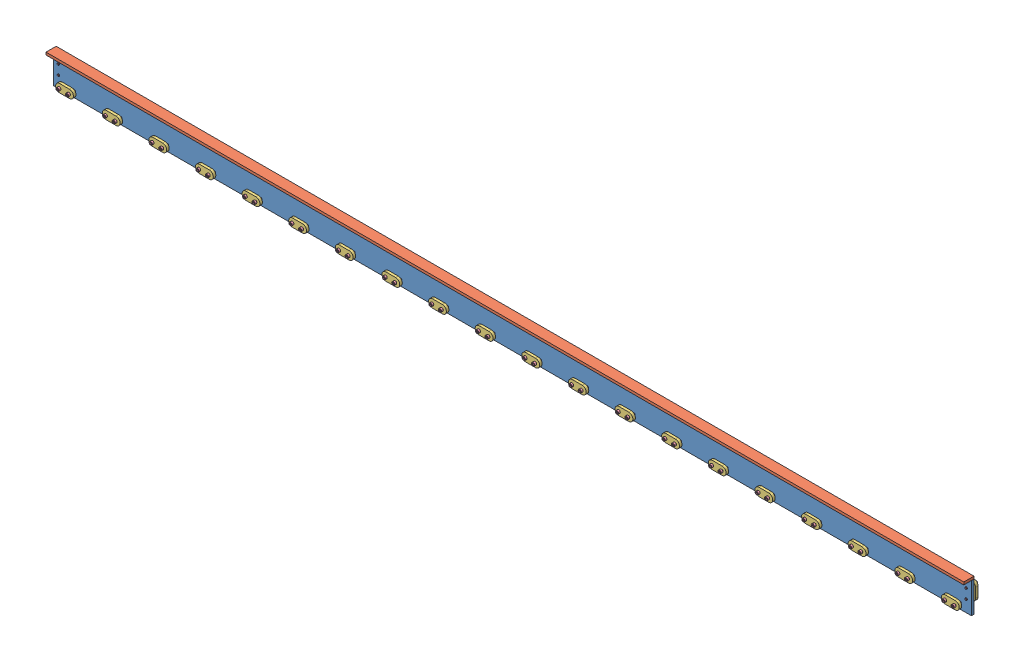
SolidWorks assembly fs-ua-angled-mount-assembly-with-screws.SLDASM, configuration Default (file format 9000). Lengths in mm.
Overall size (2292.35 82.55 44.16).
69 component instances, 4 part files, 6 mates.
Components (placement in the parent):
- fs-ua-angled-mount-assembly-1: fs-ua-angled-mount-assembly.SLDASM [Default] at origin size (2292.35 82.55 38)
  - fs-ua-angled-mount-vertical-component-1: fs-ua-angled-mount-vertical-component.SLDPRT [Default] at origin size (2292.35 76.2 6.35)
  - fs-ua-angled-mount-horizontal-component-1: fs-ua-angled-mount-horizontal-component.SLDPRT [Default] at (1146.175 76.2 12.7) size (2292.35 6.35 25.4)
  - fs-clamp-1: fs-clamp.SLDPRT [Default] at (27.94 15.24 12.8007) size (44.45 20.32 6.35)
  - fs-clamp-2: fs-clamp.SLDPRT [Default] at (144.3789 15.24 12.8007) size (44.45 20.32 6.35)
  - fs-clamp-3: fs-clamp.SLDPRT [Default] at (260.8179 15.24 12.8007) size (44.45 20.32 6.35)
  - fs-clamp-4: fs-clamp.SLDPRT [Default] at (377.2568 15.24 12.8007) size (44.45 20.32 6.35)
  - fs-clamp-5: fs-clamp.SLDPRT [Default] at (493.6957 15.24 12.8007) size (44.45 20.32 6.35)
  - fs-clamp-6: fs-clamp.SLDPRT [Default] at (610.1347 15.24 12.8007) size (44.45 20.32 6.35)
  - fs-clamp-7: fs-clamp.SLDPRT [Default] at (726.5736 15.24 12.8007) size (44.45 20.32 6.35)
  - fs-clamp-8: fs-clamp.SLDPRT [Default] at (843.0125 15.24 12.8007) size (44.45 20.32 6.35)
  - fs-clamp-9: fs-clamp.SLDPRT [Default] at (959.4515 15.24 12.8007) size (44.45 20.32 6.35)
  - fs-clamp-10: fs-clamp.SLDPRT [Default] at (1075.8904 15.24 12.8007) size (44.45 20.32 6.35)
  - fs-clamp-11: fs-clamp.SLDPRT [Default] at (1192.3293 15.24 12.8007) size (44.45 20.32 6.35)
  - fs-clamp-12: fs-clamp.SLDPRT [Default] at (1308.7683 15.24 12.8007) size (44.45 20.32 6.35)
  - fs-clamp-13: fs-clamp.SLDPRT [Default] at (1425.2072 15.24 12.8007) size (44.45 20.32 6.35)
  - fs-clamp-14: fs-clamp.SLDPRT [Default] at (1541.6461 15.24 12.8007) size (44.45 20.32 6.35)
  - fs-clamp-15: fs-clamp.SLDPRT [Default] at (1658.0851 15.24 12.8007) size (44.45 20.32 6.35)
  - fs-clamp-16: fs-clamp.SLDPRT [Default] at (1774.524 15.24 12.8007) size (44.45 20.32 6.35)
  - fs-clamp-17: fs-clamp.SLDPRT [Default] at (1890.9629 15.24 12.8007) size (44.45 20.32 6.35)
  - fs-clamp-18: fs-clamp.SLDPRT [Default] at (2007.4019 15.24 12.8007) size (44.45 20.32 6.35)
  - fs-clamp-19: fs-clamp.SLDPRT [Default] at (12.7 53.975 -12.5735) x (0 -1 0) z (0 0 1) size (44.45 20.32 6.35)
  - fs-clamp-20: fs-clamp.SLDPRT [Default] at (2279.65 29.845 -12.5985) x (0 1 0) z (0 0 1) size (44.45 20.32 6.35)
  - fs-clamp-21: fs-clamp.SLDPRT [Default] at (2123.8408 15.24 12.8007) size (44.45 20.32 6.35)
  - fs-clamp-22: fs-clamp.SLDPRT [Default] at (2240.2797 15.24 12.8007) size (44.45 20.32 6.35)
- socket head cap screw_ai-1: socket head cap screw_ai.sldprt [HX-SHCS 0.19-32x0.875x0.875-N] at (27.94 15.24 25.0524) x (0 0 -1) z (-0.570283 0.821448 0) size (27.05 7.94 7.94)
- socket head cap screw_ai-3: socket head cap screw_ai.sldprt [HX-SHCS 0.19-32x0.875x0.875-N] at (52.07 15.24 25.3347) x (0 0 -1) z (0.61191 -0.790927 0) size (27.05 7.94 7.94)
- socket head cap screw_ai-4: socket head cap screw_ai.sldprt [HX-SHCS 0.19-32x0.875x0.875-N] at (12.7 29.845 -18.7638) x (0 0 1) z (-0.601781 -0.798661 0) size (27.05 7.94 7.94)
- socket head cap screw_ai-5: socket head cap screw_ai.sldprt [HX-SHCS 0.19-32x0.875x0.875-N] at (12.7 53.975 -18.6513) x (0 0 1) z (0.101721 0.994813 0) size (27.05 7.94 7.94)
- socket head cap screw_ai-6: socket head cap screw_ai.sldprt [HX-SHCS 0.19-32x0.875x0.875-N] at (2279.65 29.845 -18.7537) x (0 0 1) z (-0.220834 -0.975311 0) size (27.05 7.94 7.94)
- socket head cap screw_ai-7: socket head cap screw_ai.sldprt [HX-SHCS 0.19-32x0.875x0.875-N] at (2279.65 53.975 -18.662) x (0 0 1) z (-0.85708 -0.515183 0) size (27.05 7.94 7.94)
- socket head cap screw_ai-8: socket head cap screw_ai.sldprt [HX-SHCS 0.19-32x0.875x0.875-N] at (144.3789 15.24 25.0524) x (0 0 -1) z (-0.570283 0.821448 0) size (27.05 7.94 7.94)
- socket head cap screw_ai-9: socket head cap screw_ai.sldprt [HX-SHCS 0.19-32x0.875x0.875-N] at (260.8179 15.24 25.0524) x (0 0 -1) z (-0.570283 0.821448 0) size (27.05 7.94 7.94)
- socket head cap screw_ai-10: socket head cap screw_ai.sldprt [HX-SHCS 0.19-32x0.875x0.875-N] at (377.2568 15.24 25.0524) x (0 0 -1) z (-0.570283 0.821448 0) size (27.05 7.94 7.94)
- socket head cap screw_ai-11: socket head cap screw_ai.sldprt [HX-SHCS 0.19-32x0.875x0.875-N] at (493.6957 15.24 25.0524) x (0 0 -1) z (-0.570283 0.821448 0) size (27.05 7.94 7.94)
- socket head cap screw_ai-12: socket head cap screw_ai.sldprt [HX-SHCS 0.19-32x0.875x0.875-N] at (610.1347 15.24 25.0524) x (0 0 -1) z (-0.570283 0.821448 0) size (27.05 7.94 7.94)
- socket head cap screw_ai-13: socket head cap screw_ai.sldprt [HX-SHCS 0.19-32x0.875x0.875-N] at (726.5736 15.24 25.0524) x (0 0 -1) z (-0.570283 0.821448 0) size (27.05 7.94 7.94)
- socket head cap screw_ai-14: socket head cap screw_ai.sldprt [HX-SHCS 0.19-32x0.875x0.875-N] at (843.0125 15.24 25.0524) x (0 0 -1) z (-0.570283 0.821448 0) size (27.05 7.94 7.94)
- socket head cap screw_ai-15: socket head cap screw_ai.sldprt [HX-SHCS 0.19-32x0.875x0.875-N] at (959.4515 15.24 25.0524) x (0 0 -1) z (-0.570283 0.821448 0) size (27.05 7.94 7.94)
- socket head cap screw_ai-16: socket head cap screw_ai.sldprt [HX-SHCS 0.19-32x0.875x0.875-N] at (1075.8904 15.24 25.0524) x (0 0 -1) z (-0.570283 0.821448 0) size (27.05 7.94 7.94)
- socket head cap screw_ai-17: socket head cap screw_ai.sldprt [HX-SHCS 0.19-32x0.875x0.875-N] at (1192.3293 15.24 25.0524) x (0 0 -1) z (-0.570283 0.821448 0) size (27.05 7.94 7.94)
- socket head cap screw_ai-18: socket head cap screw_ai.sldprt [HX-SHCS 0.19-32x0.875x0.875-N] at (1308.7683 15.24 25.0524) x (0 0 -1) z (-0.570283 0.821448 0) size (27.05 7.94 7.94)
- socket head cap screw_ai-19: socket head cap screw_ai.sldprt [HX-SHCS 0.19-32x0.875x0.875-N] at (1425.2072 15.24 25.0524) x (0 0 -1) z (-0.570283 0.821448 0) size (27.05 7.94 7.94)
- socket head cap screw_ai-20: socket head cap screw_ai.sldprt [HX-SHCS 0.19-32x0.875x0.875-N] at (1541.6461 15.24 25.0524) x (0 0 -1) z (-0.570283 0.821448 0) size (27.05 7.94 7.94)
- socket head cap screw_ai-21: socket head cap screw_ai.sldprt [HX-SHCS 0.19-32x0.875x0.875-N] at (1658.0851 15.24 25.0524) x (0 0 -1) z (-0.570283 0.821448 0) size (27.05 7.94 7.94)
- socket head cap screw_ai-22: socket head cap screw_ai.sldprt [HX-SHCS 0.19-32x0.875x0.875-N] at (1774.524 15.24 25.0524) x (0 0 -1) z (-0.570283 0.821448 0) size (27.05 7.94 7.94)
- socket head cap screw_ai-23: socket head cap screw_ai.sldprt [HX-SHCS 0.19-32x0.875x0.875-N] at (1890.9629 15.24 25.0524) x (0 0 -1) z (-0.570283 0.821448 0) size (27.05 7.94 7.94)
- socket head cap screw_ai-24: socket head cap screw_ai.sldprt [HX-SHCS 0.19-32x0.875x0.875-N] at (2007.4019 15.24 25.0524) x (0 0 -1) z (-0.570283 0.821448 0) size (27.05 7.94 7.94)
- socket head cap screw_ai-25: socket head cap screw_ai.sldprt [HX-SHCS 0.19-32x0.875x0.875-N] at (168.4835 15.24 25.3347) x (0 0 -1) z (0.61191 -0.790927 0) size (27.05 7.94 7.94)
- socket head cap screw_ai-26: socket head cap screw_ai.sldprt [HX-SHCS 0.19-32x0.875x0.875-N] at (284.8971 15.24 25.3347) x (0 0 -1) z (0.61191 -0.790927 0) size (27.05 7.94 7.94)
- socket head cap screw_ai-27: socket head cap screw_ai.sldprt [HX-SHCS 0.19-32x0.875x0.875-N] at (401.3106 15.24 25.3347) x (0 0 -1) z (0.61191 -0.790927 0) size (27.05 7.94 7.94)
- socket head cap screw_ai-28: socket head cap screw_ai.sldprt [HX-SHCS 0.19-32x0.875x0.875-N] at (517.7241 15.24 25.3347) x (0 0 -1) z (0.61191 -0.790927 0) size (27.05 7.94 7.94)
- socket head cap screw_ai-29: socket head cap screw_ai.sldprt [HX-SHCS 0.19-32x0.875x0.875-N] at (634.1377 15.24 25.3347) x (0 0 -1) z (0.61191 -0.790927 0) size (27.05 7.94 7.94)
- socket head cap screw_ai-30: socket head cap screw_ai.sldprt [HX-SHCS 0.19-32x0.875x0.875-N] at (750.5512 15.24 25.3347) x (0 0 -1) z (0.61191 -0.790927 0) size (27.05 7.94 7.94)
- socket head cap screw_ai-31: socket head cap screw_ai.sldprt [HX-SHCS 0.19-32x0.875x0.875-N] at (866.9647 15.24 25.3347) x (0 0 -1) z (0.61191 -0.790927 0) size (27.05 7.94 7.94)
- socket head cap screw_ai-32: socket head cap screw_ai.sldprt [HX-SHCS 0.19-32x0.875x0.875-N] at (983.3783 15.24 25.3347) x (0 0 -1) z (0.61191 -0.790927 0) size (27.05 7.94 7.94)
- socket head cap screw_ai-33: socket head cap screw_ai.sldprt [HX-SHCS 0.19-32x0.875x0.875-N] at (1099.7918 15.24 25.3347) x (0 0 -1) z (0.61191 -0.790927 0) size (27.05 7.94 7.94)
- socket head cap screw_ai-34: socket head cap screw_ai.sldprt [HX-SHCS 0.19-32x0.875x0.875-N] at (1216.2053 15.24 25.3347) x (0 0 -1) z (0.61191 -0.790927 0) size (27.05 7.94 7.94)
- socket head cap screw_ai-35: socket head cap screw_ai.sldprt [HX-SHCS 0.19-32x0.875x0.875-N] at (1332.6189 15.24 25.3347) x (0 0 -1) z (0.61191 -0.790927 0) size (27.05 7.94 7.94)
- socket head cap screw_ai-36: socket head cap screw_ai.sldprt [HX-SHCS 0.19-32x0.875x0.875-N] at (1449.0324 15.24 25.3347) x (0 0 -1) z (0.61191 -0.790927 0) size (27.05 7.94 7.94)
- socket head cap screw_ai-37: socket head cap screw_ai.sldprt [HX-SHCS 0.19-32x0.875x0.875-N] at (1565.4459 15.24 25.3347) x (0 0 -1) z (0.61191 -0.790927 0) size (27.05 7.94 7.94)
- socket head cap screw_ai-38: socket head cap screw_ai.sldprt [HX-SHCS 0.19-32x0.875x0.875-N] at (1681.8595 15.24 25.3347) x (0 0 -1) z (0.61191 -0.790927 0) size (27.05 7.94 7.94)
- socket head cap screw_ai-39: socket head cap screw_ai.sldprt [HX-SHCS 0.19-32x0.875x0.875-N] at (1798.273 15.24 25.3347) x (0 0 -1) z (0.61191 -0.790927 0) size (27.05 7.94 7.94)
- socket head cap screw_ai-40: socket head cap screw_ai.sldprt [HX-SHCS 0.19-32x0.875x0.875-N] at (1914.6865 15.24 25.3347) x (0 0 -1) z (0.61191 -0.790927 0) size (27.05 7.94 7.94)
- socket head cap screw_ai-41: socket head cap screw_ai.sldprt [HX-SHCS 0.19-32x0.875x0.875-N] at (2031.1001 15.24 25.3347) x (0 0 -1) z (0.61191 -0.790927 0) size (27.05 7.94 7.94)
- socket head cap screw_ai-42: socket head cap screw_ai.sldprt [HX-SHCS 0.19-32x0.875x0.875-N] at (2123.8408 15.24 25.0524) x (0 0 -1) z (-0.570283 0.821448 0) size (27.05 7.94 7.94)
- socket head cap screw_ai-43: socket head cap screw_ai.sldprt [HX-SHCS 0.19-32x0.875x0.875-N] at (2240.2797 15.24 25.0524) x (0 0 -1) z (-0.570283 0.821448 0) size (27.05 7.94 7.94)
- socket head cap screw_ai-44: socket head cap screw_ai.sldprt [HX-SHCS 0.19-32x0.875x0.875-N] at (2147.5136 15.24 25.3347) x (0 0 -1) z (0.61191 -0.790927 0) size (27.05 7.94 7.94)
- socket head cap screw_ai-45: socket head cap screw_ai.sldprt [HX-SHCS 0.19-32x0.875x0.875-N] at (2263.9271 15.24 25.3347) x (0 0 -1) z (0.61191 -0.790927 0) size (27.05 7.94 7.94)
Mates (geometry in assembly coordinates):
- Concentric1: concentric anti-aligned: cylinder of fs-ua-angled-mount-assembly-1/fs-clamp-1 through (27.94 15.24 19.1507) axis (0 0 -1) radius 2.54; cylinder of socket head cap screw_ai-1 through (27.94 15.24 56.8024) axis (0 0 1) radius 2.413
- Concentric2: concentric anti-aligned: cylinder of fs-ua-angled-mount-assembly-1/fs-clamp-1 through (52.07 15.24 19.1507) axis (0 0 -1) radius 2.54; cylinder of socket head cap screw_ai-3 through (52.07 15.24 57.0847) axis (0 0 1) radius 2.413
- Concentric3: concentric aligned: cylinder of fs-ua-angled-mount-assembly-1/fs-clamp-20 through (2279.65 53.975 -6.2485) axis (0 0 -1) radius 2.54; cylinder of socket head cap screw_ai-7 through (2279.65 53.975 -50.412) axis (0 0 -1) radius 2.413
- Concentric4: concentric aligned: cylinder of fs-ua-angled-mount-assembly-1/fs-clamp-20 through (2279.65 29.845 -6.2485) axis (0 0 -1) radius 2.54; cylinder of socket head cap screw_ai-6 through (2279.65 29.845 -50.5037) axis (0 0 -1) radius 2.413
- Concentric5: concentric aligned: cylinder of fs-ua-angled-mount-assembly-1/fs-clamp-19 through (12.7 53.975 -6.2235) axis (0 0 -1) radius 2.54; cylinder of socket head cap screw_ai-5 through (12.7 53.975 -50.4013) axis (0 0 -1) radius 2.413
- Concentric6: concentric aligned: cylinder of fs-ua-angled-mount-assembly-1/fs-clamp-19 through (12.7 29.845 -6.2235) axis (0 0 -1) radius 2.54; cylinder of socket head cap screw_ai-4 through (12.7 29.845 -50.5138) axis (0 0 -1) radius 2.413
